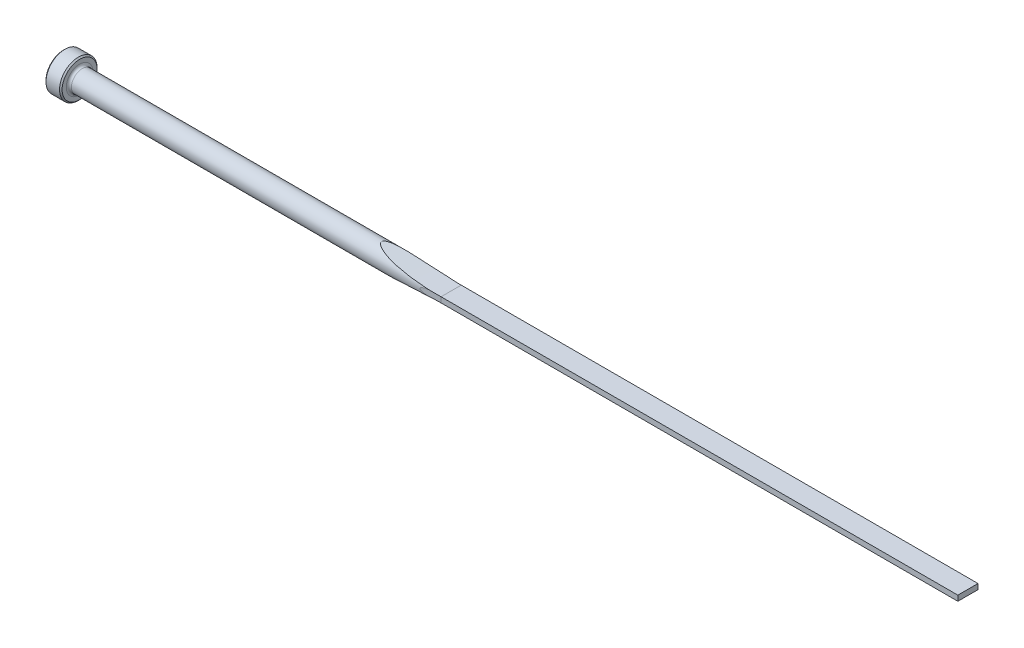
ISO-10303-21;
HEADER;
FILE_DESCRIPTION(('STEP AP214'),'2;1');
FILE_NAME('part.step','',(''),(''),'','','');
FILE_SCHEMA(('AUTOMOTIVE_DESIGN { 1 0 10303 214 1 1 1 1 }'));
ENDSEC;
DATA;
#1=APPLICATION_CONTEXT('core data for automotive mechanical design processes');
#2=APPLICATION_PROTOCOL_DEFINITION('international standard','automotive_design',2000,#1);
#3=PRODUCT_CONTEXT('',#1,'mechanical');
#4=PRODUCT('Part','Part','',(#3));
#5=PRODUCT_RELATED_PRODUCT_CATEGORY('part','',(#4));
#6=PRODUCT_DEFINITION_FORMATION('','',#4);
#7=PRODUCT_DEFINITION_CONTEXT('part definition',#1,'design');
#8=PRODUCT_DEFINITION('design','',#6,#7);
#9=PRODUCT_DEFINITION_SHAPE('','',#8);
#10=(LENGTH_UNIT() NAMED_UNIT(*) SI_UNIT(.MILLI.,.METRE.));
#11=(NAMED_UNIT(*) PLANE_ANGLE_UNIT() SI_UNIT($,.RADIAN.));
#12=(NAMED_UNIT(*) SI_UNIT($,.STERADIAN.) SOLID_ANGLE_UNIT());
#13=UNCERTAINTY_MEASURE_WITH_UNIT(LENGTH_MEASURE(1.E-05),#10,'distance_accuracy_value','');
#14=(GEOMETRIC_REPRESENTATION_CONTEXT(3) GLOBAL_UNCERTAINTY_ASSIGNED_CONTEXT((#13)) GLOBAL_UNIT_ASSIGNED_CONTEXT((#10,
#11,#12)) REPRESENTATION_CONTEXT('',''));
#15=CARTESIAN_POINT('',(0.,0.,0.));
#16=DIRECTION('',(0.,0.,1.));
#17=DIRECTION('',(1.,0.,0.));
#18=AXIS2_PLACEMENT_3D('',#15,#16,#17);
#19=CARTESIAN_POINT('',(0.,0.,0.));
#20=DIRECTION('',(-1.,0.,0.));
#21=DIRECTION('',(0.,0.,1.));
#22=AXIS2_PLACEMENT_3D('',#19,#20,#21);
#23=CYLINDRICAL_SURFACE('',#22,3.175);
#24=CARTESIAN_POINT('',(5.5118,0.,0.));
#25=DIRECTION('',(-1.,0.,0.));
#26=DIRECTION('',(0.,0.,1.));
#27=AXIS2_PLACEMENT_3D('',#24,#25,#26);
#28=CIRCLE('',#27,3.175);
#29=CARTESIAN_POINT('',(5.5118,0.,3.175));
#30=VERTEX_POINT('',#29);
#31=EDGE_CURVE('E153',#30,#30,#28,.F.);
#32=ORIENTED_EDGE('',*,*,#31,.T.);
#33=EDGE_LOOP('',(#32));
#34=FACE_BOUND('',#33,.T.);
#35=CARTESIAN_POINT('',(114.3,1.11760000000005,2.97179999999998));
#36=CARTESIAN_POINT('',(114.035795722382,1.11753103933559,2.97179889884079));
#37=CARTESIAN_POINT('',(113.771581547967,1.11446404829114,2.97297778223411));
#38=CARTESIAN_POINT('',(113.243191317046,1.10185346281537,2.97768913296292));
#39=CARTESIAN_POINT('',(112.979015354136,1.09230645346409,2.98122284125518));
#40=CARTESIAN_POINT('',(112.449383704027,1.06617269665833,2.99066695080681));
#41=CARTESIAN_POINT('',(112.183930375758,1.04954219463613,2.99659211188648));
#42=CARTESIAN_POINT('',(111.653787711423,1.00807205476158,3.01079697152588));
#43=CARTESIAN_POINT('',(111.389098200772,0.983234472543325,3.01907608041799));
#44=CARTESIAN_POINT('',(110.861578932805,0.92338352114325,3.03792875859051));
#45=CARTESIAN_POINT('',(110.598746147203,0.888396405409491,3.04849639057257));
#46=CARTESIAN_POINT('',(110.206465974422,0.825064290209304,3.06600005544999));
#47=CARTESIAN_POINT('',(110.076108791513,0.802161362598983,3.07210597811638));
#48=CARTESIAN_POINT('',(109.816355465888,0.751700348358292,3.08484243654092));
#49=CARTESIAN_POINT('',(109.686959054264,0.724143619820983,3.09147281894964));
#50=CARTESIAN_POINT('',(109.429407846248,0.662714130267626,3.10522998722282));
#51=CARTESIAN_POINT('',(109.301255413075,0.62883116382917,3.11235756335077));
#52=CARTESIAN_POINT('',(109.111128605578,0.570760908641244,3.12333709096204));
#53=CARTESIAN_POINT('',(109.048049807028,0.55017562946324,3.12704828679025));
#54=CARTESIAN_POINT('',(108.92304566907,0.505797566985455,3.13453462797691));
#55=CARTESIAN_POINT('',(108.861119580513,0.482006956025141,3.13830972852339));
#56=CARTESIAN_POINT('',(108.738826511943,0.429769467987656,3.14588980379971));
#57=CARTESIAN_POINT('',(108.678471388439,0.401294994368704,3.14969481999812));
#58=CARTESIAN_POINT('',(108.561395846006,0.337410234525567,3.1571914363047));
#59=CARTESIAN_POINT('',(108.504663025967,0.302025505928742,3.16088339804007));
#60=CARTESIAN_POINT('',(108.431845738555,0.243613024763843,3.16568281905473));
#61=CARTESIAN_POINT('',(108.411687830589,0.225790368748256,3.16701915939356));
#62=CARTESIAN_POINT('',(108.374124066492,0.187442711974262,3.16952077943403));
#63=CARTESIAN_POINT('',(108.356707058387,0.166929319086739,3.17068675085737));
#64=CARTESIAN_POINT('',(108.333583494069,0.132884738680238,3.17224001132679));
#65=CARTESIAN_POINT('',(108.326188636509,0.120518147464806,3.17273788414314));
#66=CARTESIAN_POINT('',(108.313260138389,0.0948283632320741,3.1736095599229));
#67=CARTESIAN_POINT('',(108.307725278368,0.081505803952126,3.17398344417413));
#68=CARTESIAN_POINT('',(108.299008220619,0.0538971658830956,3.1745727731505));
#69=CARTESIAN_POINT('',(108.295856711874,0.0396010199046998,3.17478615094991));
#70=CARTESIAN_POINT('',(108.2924789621,0.0106696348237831,3.17501485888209));
#71=CARTESIAN_POINT('',(108.292248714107,-0.00396511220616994,3.17503046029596));
#72=CARTESIAN_POINT('',(108.294559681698,-0.0309283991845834,3.17487397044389));
#73=CARTESIAN_POINT('',(108.29671675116,-0.0432925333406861,3.17472789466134));
#74=CARTESIAN_POINT('',(108.302965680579,-0.0675187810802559,3.17430516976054));
#75=CARTESIAN_POINT('',(108.307059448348,-0.0793803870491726,3.17402839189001));
#76=CARTESIAN_POINT('',(108.319137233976,-0.107852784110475,3.17321302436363));
#77=CARTESIAN_POINT('',(108.328045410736,-0.124065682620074,3.17261252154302));
#78=CARTESIAN_POINT('',(108.34823262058,-0.154926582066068,3.17125564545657));
#79=CARTESIAN_POINT('',(108.359518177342,-0.169570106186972,3.17049884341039));
#80=CARTESIAN_POINT('',(108.39443410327,-0.20990010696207,3.16816531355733));
#81=CARTESIAN_POINT('',(108.420099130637,-0.233790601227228,3.16645919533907));
#82=CARTESIAN_POINT('',(108.474292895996,-0.277993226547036,3.16288336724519));
#83=CARTESIAN_POINT('',(108.502830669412,-0.29829347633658,3.16101314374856));
#84=CARTESIAN_POINT('',(108.58234132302,-0.349789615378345,3.15584379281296));
#85=CARTESIAN_POINT('',(108.63488873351,-0.378519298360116,3.15247078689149));
#86=CARTESIAN_POINT('',(108.742307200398,-0.43132017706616,3.14567655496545));
#87=CARTESIAN_POINT('',(108.797183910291,-0.455379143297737,3.14225522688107));
#88=CARTESIAN_POINT('',(108.908570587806,-0.500302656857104,3.13541729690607));
#89=CARTESIAN_POINT('',(108.965087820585,-0.521149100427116,3.13200082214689));
#90=CARTESIAN_POINT('',(109.07889793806,-0.560302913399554,3.12523191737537));
#91=CARTESIAN_POINT('',(109.136189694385,-0.578613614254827,3.12187940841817));
#92=CARTESIAN_POINT('',(109.329729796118,-0.636913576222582,3.11074477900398));
#93=CARTESIAN_POINT('',(109.467313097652,-0.672489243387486,3.10314401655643));
#94=CARTESIAN_POINT('',(109.744130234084,-0.736755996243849,3.08850582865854));
#95=CARTESIAN_POINT('',(109.883365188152,-0.765442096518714,3.08146881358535));
#96=CARTESIAN_POINT('',(110.163129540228,-0.817784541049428,3.06799404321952));
#97=CARTESIAN_POINT('',(110.303661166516,-0.841429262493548,3.06155769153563));
#98=CARTESIAN_POINT('',(110.58537320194,-0.884713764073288,3.04932851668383));
#99=CARTESIAN_POINT('',(110.726553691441,-0.904353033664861,3.04353577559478));
#100=CARTESIAN_POINT('',(111.150689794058,-0.958348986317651,3.02714982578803));
#101=CARTESIAN_POINT('',(111.434309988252,-0.987796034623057,3.01754551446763));
#102=CARTESIAN_POINT('',(112.002086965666,-1.03680456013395,3.00105004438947));
#103=CARTESIAN_POINT('',(112.286242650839,-1.05637822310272,2.99415554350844));
#104=CARTESIAN_POINT('',(112.714916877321,-1.0796290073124,2.98581493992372));
#105=CARTESIAN_POINT('',(112.859256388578,-1.08638681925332,2.98335806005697));
#106=CARTESIAN_POINT('',(113.148064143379,-1.09788498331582,2.97914616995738));
#107=CARTESIAN_POINT('',(113.292532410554,-1.10262481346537,2.9773913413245));
#108=CARTESIAN_POINT('',(113.580840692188,-1.11015348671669,2.9745925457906));
#109=CARTESIAN_POINT('',(113.724680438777,-1.11295147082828,2.97354524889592));
#110=CARTESIAN_POINT('',(114.012346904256,-1.11667170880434,2.97214903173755));
#111=CARTESIAN_POINT('',(114.156173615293,-1.11759449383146,2.97179991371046));
#112=CARTESIAN_POINT('',(114.3,-1.11760000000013,2.97179999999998));
#113=B_SPLINE_CURVE_WITH_KNOTS('',3,(#35,#36,#37,#38,#39,#40,#41,#42,#43,#44,#45,#46,#47,#48,
#49,#50,#51,#52,#53,#54,#55,#56,#57,#58,#59,#60,#61,#62,#63,#64,#65,#66,#67,#68,#69,#70,#71,#72,
#73,#74,#75,#76,#77,#78,#79,#80,#81,#82,#83,#84,#85,#86,#87,#88,#89,#90,#91,#92,#93,#94,#95,#96,
#97,#98,#99,#100,#101,#102,#103,#104,#105,#106,#107,#108,#109,#110,#111,#112),.UNSPECIFIED.,.F.,
.F.,(4,2,2,2,2,2,2,2,2,2,2,2,2,2,2,2,2,2,2,2,2,2,2,2,2,2,2,2,2,2,2,2,2,2,2,2,2,2,4),(0.,
0.792608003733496,1.58563403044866,2.38363126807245,3.18142878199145,3.97718078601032,
4.37459807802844,4.77189959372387,5.16984765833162,5.36916585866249,5.5683496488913,
5.76875204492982,5.96842682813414,6.04909120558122,6.12941838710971,6.17255460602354,
6.21566248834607,6.2593164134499,6.30291045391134,6.34039079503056,6.37790813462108,
6.43311579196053,6.4884769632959,6.59320183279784,6.69826703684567,6.87774508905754,
7.05768691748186,7.23860836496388,7.41928981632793,7.84588397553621,8.27278590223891,
8.70066164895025,9.12859189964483,9.98423938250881,10.8388282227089,11.2723701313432,
11.7060241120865,12.137622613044,12.569098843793),.UNSPECIFIED.);
#114=CARTESIAN_POINT('',(110.485302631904,0.869282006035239,3.05368200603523));
#115=VERTEX_POINT('',#114);
#116=CARTESIAN_POINT('',(110.485302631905,-0.869282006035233,3.05368200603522));
#117=VERTEX_POINT('',#116);
#118=EDGE_CURVE('E156',#115,#117,#113,.T.);
#119=ORIENTED_EDGE('',*,*,#118,.F.);
#120=CARTESIAN_POINT('',(114.3,0.787399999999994,3.07581310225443));
#121=CARTESIAN_POINT('',(114.035543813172,0.787399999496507,3.07581083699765));
#122=CARTESIAN_POINT('',(113.771089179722,0.788580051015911,3.07551132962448));
#123=CARTESIAN_POINT('',(113.24220228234,0.793300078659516,3.07429803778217));
#124=CARTESIAN_POINT('',(112.977770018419,0.796840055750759,3.07338425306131));
#125=CARTESIAN_POINT('',(112.184418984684,0.81100169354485,3.0696912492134));
#126=CARTESIAN_POINT('',(111.655563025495,0.82516506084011,3.06596036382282));
#127=CARTESIAN_POINT('',(110.596850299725,0.862977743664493,3.05553241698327));
#128=CARTESIAN_POINT('',(110.066994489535,0.886651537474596,3.04882769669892));
#129=CARTESIAN_POINT('',(109.007960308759,0.943468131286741,3.03172836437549));
#130=CARTESIAN_POINT('',(108.478781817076,0.976608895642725,3.02133454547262));
#131=CARTESIAN_POINT('',(107.499749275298,1.04671882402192,2.99769210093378));
#132=CARTESIAN_POINT('',(107.04978615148,1.08238846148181,2.98509669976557));
#133=CARTESIAN_POINT('',(106.150579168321,1.16056445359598,2.9555818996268));
#134=CARTESIAN_POINT('',(105.701335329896,1.203071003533,2.93866237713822));
#135=CARTESIAN_POINT('',(104.803288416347,1.29494318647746,2.89935313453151));
#136=CARTESIAN_POINT('',(104.354486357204,1.34431625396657,2.87695746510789));
#137=CARTESIAN_POINT('',(103.458095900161,1.44984136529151,2.82525115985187));
#138=CARTESIAN_POINT('',(103.01050743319,1.50599301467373,2.79594092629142));
#139=CARTESIAN_POINT('',(102.11575117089,1.62515896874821,2.72840404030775));
#140=CARTESIAN_POINT('',(101.66858730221,1.6881902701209,2.69015502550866));
#141=CARTESIAN_POINT('',(100.776227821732,1.82090442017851,2.60217475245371));
#142=CARTESIAN_POINT('',(100.331032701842,1.89058884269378,2.5524407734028));
#143=CARTESIAN_POINT('',(99.6659910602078,1.99985162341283,2.46644191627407));
#144=CARTESIAN_POINT('',(99.4450024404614,2.03701989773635,2.43591445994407));
#145=CARTESIAN_POINT('',(99.0039601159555,2.11291046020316,2.37039160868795));
#146=CARTESIAN_POINT('',(98.7839063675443,2.15163267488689,2.33539642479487));
#147=CARTESIAN_POINT('',(98.3450648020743,2.23055506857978,2.2601373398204));
#148=CARTESIAN_POINT('',(98.1262764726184,2.27075459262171,2.21987575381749));
#149=CARTESIAN_POINT('',(97.6902406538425,2.35255542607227,2.13299737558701));
#150=CARTESIAN_POINT('',(97.4729929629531,2.39415654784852,2.08638143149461));
#151=CARTESIAN_POINT('',(97.1477545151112,2.45768704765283,2.01034767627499));
#152=CARTESIAN_POINT('',(97.0389864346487,2.47914563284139,1.98385903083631));
#153=CARTESIAN_POINT('',(96.822086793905,2.52235662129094,1.9286178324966));
#154=CARTESIAN_POINT('',(96.7139552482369,2.54410903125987,1.89986522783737));
#155=CARTESIAN_POINT('',(96.3903801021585,2.60982577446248,1.8097032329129));
#156=CARTESIAN_POINT('',(96.1760432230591,2.65419348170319,1.74445519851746));
#157=CARTESIAN_POINT('',(95.8591981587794,2.7209791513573,1.63665429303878));
#158=CARTESIAN_POINT('',(95.7548736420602,2.74316775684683,1.5992785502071));
#159=CARTESIAN_POINT('',(95.5477705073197,2.78760086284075,1.5205128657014));
#160=CARTESIAN_POINT('',(95.4449915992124,2.80984535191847,1.47912368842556));
#161=CARTESIAN_POINT('',(95.2417053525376,2.85421389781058,1.39157880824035));
#162=CARTESIAN_POINT('',(95.1411937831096,2.87633810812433,1.34543306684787));
#163=CARTESIAN_POINT('',(94.9430959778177,2.9202948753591,1.24716139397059));
#164=CARTESIAN_POINT('',(94.8455078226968,2.94212761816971,1.19503949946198));
#165=CARTESIAN_POINT('',(94.7117813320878,2.97227306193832,1.11659829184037));
#166=CARTESIAN_POINT('',(94.6738115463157,2.9808592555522,1.09349968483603));
#167=CARTESIAN_POINT('',(94.5987226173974,2.9978899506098,1.04590629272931));
#168=CARTESIAN_POINT('',(94.5616035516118,3.00633443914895,1.02141138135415));
#169=CARTESIAN_POINT('',(94.4515401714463,3.03144638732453,0.945421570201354));
#170=CARTESIAN_POINT('',(94.380121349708,3.04784006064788,0.891554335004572));
#171=CARTESIAN_POINT('',(94.2427883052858,3.07952922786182,0.775133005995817));
#172=CARTESIAN_POINT('',(94.1769534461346,3.09480855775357,0.712479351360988));
#173=CARTESIAN_POINT('',(94.0563432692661,3.12292613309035,0.576813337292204));
#174=CARTESIAN_POINT('',(94.0015101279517,3.13577711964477,0.503858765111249));
#175=CARTESIAN_POINT('',(93.9334503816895,3.15177595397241,0.385387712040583));
#176=CARTESIAN_POINT('',(93.9130844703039,3.15657317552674,0.34423696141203));
#177=CARTESIAN_POINT('',(93.878672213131,3.16468806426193,0.25921672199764));
#178=CARTESIAN_POINT('',(93.8646188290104,3.16800737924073,0.215350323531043));
#179=CARTESIAN_POINT('',(93.8441287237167,3.17284949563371,0.125287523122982));
#180=CARTESIAN_POINT('',(93.8377647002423,3.1743551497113,0.0790731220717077));
#181=CARTESIAN_POINT('',(93.833732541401,3.17530892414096,-0.0137573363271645));
#182=CARTESIAN_POINT('',(93.8360615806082,3.17475771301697,-0.060373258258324));
#183=CARTESIAN_POINT('',(93.8484201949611,3.17183542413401,-0.147654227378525));
#184=CARTESIAN_POINT('',(93.8576480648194,3.16965382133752,-0.188444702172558));
#185=CARTESIAN_POINT('',(93.8819667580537,3.16391143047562,-0.268119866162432));
#186=CARTESIAN_POINT('',(93.8970614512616,3.16034973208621,-0.307003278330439));
#187=CARTESIAN_POINT('',(93.9419420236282,3.149776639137,-0.403821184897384));
#188=CARTESIAN_POINT('',(93.9752036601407,3.14195464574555,-0.460042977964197));
#189=CARTESIAN_POINT('',(94.0496780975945,3.12449841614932,-0.566634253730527));
#190=CARTESIAN_POINT('',(94.0909151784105,3.11485864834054,-0.616985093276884));
#191=CARTESIAN_POINT('',(94.1763515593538,3.09496038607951,-0.709911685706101));
#192=CARTESIAN_POINT('',(94.2202749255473,3.08476245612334,-0.752759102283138));
#193=CARTESIAN_POINT('',(94.3115201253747,3.06365689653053,-0.834515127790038));
#194=CARTESIAN_POINT('',(94.3588452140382,3.05274858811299,-0.873419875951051));
#195=CARTESIAN_POINT('',(94.4560433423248,3.0304333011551,-0.947952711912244));
#196=CARTESIAN_POINT('',(94.50592175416,3.01902527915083,-0.983573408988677));
#197=CARTESIAN_POINT('',(94.6074943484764,2.9958898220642,-1.05193545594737));
#198=CARTESIAN_POINT('',(94.659187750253,2.98416252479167,-1.08467802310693));
#199=CARTESIAN_POINT('',(94.7974109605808,2.95293886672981,-1.16783092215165));
#200=CARTESIAN_POINT('',(94.88513100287,2.93325796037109,-1.2161903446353));
#201=CARTESIAN_POINT('',(95.0631864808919,2.89360215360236,-1.30773540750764));
#202=CARTESIAN_POINT('',(95.1535233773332,2.87362709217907,-1.35091808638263));
#203=CARTESIAN_POINT('',(95.336239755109,2.8335309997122,-1.43311613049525));
#204=CARTESIAN_POINT('',(95.4286227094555,2.81340976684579,-1.47212362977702));
#205=CARTESIAN_POINT('',(95.6148168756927,2.77317207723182,-1.54658525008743));
#206=CARTESIAN_POINT('',(95.708628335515,2.75305562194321,-1.5820387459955));
#207=CARTESIAN_POINT('',(95.9926824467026,2.69263186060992,-1.68424564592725));
#208=CARTESIAN_POINT('',(96.1846014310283,2.65245744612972,-1.74643627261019));
#209=CARTESIAN_POINT('',(96.4744533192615,2.59279838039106,-1.83281823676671));
#210=CARTESIAN_POINT('',(96.5713413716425,2.57302402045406,-1.86044719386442));
#211=CARTESIAN_POINT('',(96.7657197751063,2.53369185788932,-1.91366898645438));
#212=CARTESIAN_POINT('',(96.8632101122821,2.51413405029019,-1.93926186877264));
#213=CARTESIAN_POINT('',(97.1708756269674,2.45295213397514,-2.01698242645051));
#214=CARTESIAN_POINT('',(97.3819621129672,2.41176464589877,-2.06585236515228));
#215=CARTESIAN_POINT('',(97.8058251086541,2.33066711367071,-2.15692409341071));
#216=CARTESIAN_POINT('',(98.018601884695,2.29075727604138,-2.19912480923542));
#217=CARTESIAN_POINT('',(98.4455328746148,2.21230068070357,-2.27803601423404));
#218=CARTESIAN_POINT('',(98.6596877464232,2.17375464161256,-2.31474364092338));
#219=CARTESIAN_POINT('',(99.0890012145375,2.09811389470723,-2.38351552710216));
#220=CARTESIAN_POINT('',(99.3041598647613,2.0610192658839,-2.41557953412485));
#221=CARTESIAN_POINT('',(99.9518637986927,1.95181443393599,-2.50600220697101));
#222=CARTESIAN_POINT('',(100.385625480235,1.88196933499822,-2.55841192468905));
#223=CARTESIAN_POINT('',(101.255208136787,1.74857514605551,-2.65135263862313));
#224=CARTESIAN_POINT('',(101.691028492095,1.68502427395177,-2.69188700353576));
#225=CARTESIAN_POINT('',(102.564605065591,1.56427552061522,-2.76380276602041));
#226=CARTESIAN_POINT('',(103.002362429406,1.50708213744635,-2.79517770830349));
#227=CARTESIAN_POINT('',(103.879151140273,1.3991729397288,-2.85072181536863));
#228=CARTESIAN_POINT('',(104.318182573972,1.34845757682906,-2.8748904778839));
#229=CARTESIAN_POINT('',(105.196664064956,1.25361567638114,-2.91749372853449));
#230=CARTESIAN_POINT('',(105.636112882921,1.20948085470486,-2.93593555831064));
#231=CARTESIAN_POINT('',(106.515786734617,1.12775252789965,-2.96828666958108));
#232=CARTESIAN_POINT('',(106.956011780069,1.09015912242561,-2.98219588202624));
#233=CARTESIAN_POINT('',(107.9721267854,1.01101466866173,-3.01010743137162));
#234=CARTESIAN_POINT('',(108.548233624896,0.971783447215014,-3.0228311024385));
#235=CARTESIAN_POINT('',(109.701337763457,0.904541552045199,-3.04362622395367));
#236=CARTESIAN_POINT('',(110.278335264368,0.876533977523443,-3.05169638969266));
#237=CARTESIAN_POINT('',(111.429420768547,0.831901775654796,-3.06416391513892));
#238=CARTESIAN_POINT('',(112.003505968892,0.815211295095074,-3.06858255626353));
#239=CARTESIAN_POINT('',(112.864711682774,0.798523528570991,-3.07294853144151));
#240=CARTESIAN_POINT('',(113.151751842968,0.794352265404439,-3.07402686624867));
#241=CARTESIAN_POINT('',(113.725860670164,0.788790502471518,-3.07545758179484));
#242=CARTESIAN_POINT('',(114.012929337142,0.787400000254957,-3.07580996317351));
#243=CARTESIAN_POINT('',(114.3,0.7874,-3.07581310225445));
#244=B_SPLINE_CURVE_WITH_KNOTS('',3,(#120,#121,#122,#123,#124,#125,#126,#127,#128,#129,#130,
#131,#132,#133,#134,#135,#136,#137,#138,#139,#140,#141,#142,#143,#144,#145,#146,#147,#148,#149,
#150,#151,#152,#153,#154,#155,#156,#157,#158,#159,#160,#161,#162,#163,#164,#165,#166,#167,#168,
#169,#170,#171,#172,#173,#174,#175,#176,#177,#178,#179,#180,#181,#182,#183,#184,#185,#186,#187,
#188,#189,#190,#191,#192,#193,#194,#195,#196,#197,#198,#199,#200,#201,#202,#203,#204,#205,#206,
#207,#208,#209,#210,#211,#212,#213,#214,#215,#216,#217,#218,#219,#220,#221,#222,#223,#224,#225,
#226,#227,#228,#229,#230,#231,#232,#233,#234,#235,#236,#237,#238,#239,#240,#241,#242,#243),
.UNSPECIFIED.,.F.,.F.,(4,2,2,2,2,2,2,2,2,2,2,2,2,2,2,2,2,2,2,2,2,2,2,2,2,2,2,2,2,2,2,2,2,2,2,2,
2,2,2,2,2,2,2,2,2,2,2,2,2,2,2,2,2,2,2,2,2,2,2,2,2,4),(0.,0.793362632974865,1.58672559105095,
3.17380261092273,4.76499095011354,6.35583739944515,7.71042211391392,9.06504552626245,
10.4211471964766,11.7771699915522,13.1366222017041,14.4963967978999,15.1748434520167,
15.8532580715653,16.5313754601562,17.2094024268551,17.5513342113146,17.8932738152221,
18.5780521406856,18.917044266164,19.2559719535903,19.5942037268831,19.9322083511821,
20.0679784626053,20.203760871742,20.4761399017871,20.7519011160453,21.0261726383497,
21.1642406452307,21.302154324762,21.4413619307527,21.5805242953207,21.705627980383,
21.8308143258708,22.0270516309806,22.2238960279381,22.4102246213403,22.5967339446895,
22.783653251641,22.9704931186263,23.2765002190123,23.5826815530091,23.889429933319,
24.1962321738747,24.8129775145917,25.12098443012,25.4289842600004,26.0904791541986,
26.7520804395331,27.4140252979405,28.0760061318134,29.4030977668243,30.7298125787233,
32.0574601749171,33.3852002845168,34.7112545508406,36.037329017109,37.7699311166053,
39.5030113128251,41.2259182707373,42.087123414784,42.948327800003),.UNSPECIFIED.);
#245=CARTESIAN_POINT('',(110.485302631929,0.869282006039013,-3.05368200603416));
#246=VERTEX_POINT('',#245);
#247=EDGE_CURVE('E106',#115,#246,#244,.T.);
#248=ORIENTED_EDGE('',*,*,#247,.T.);
#249=CARTESIAN_POINT('',(114.3,1.11760000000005,-2.97179999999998));
#250=CARTESIAN_POINT('',(114.035795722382,1.11753103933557,-2.9717988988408));
#251=CARTESIAN_POINT('',(113.771581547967,1.11446404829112,-2.97297778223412));
#252=CARTESIAN_POINT('',(113.243191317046,1.10185346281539,-2.97768913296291));
#253=CARTESIAN_POINT('',(112.979015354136,1.09230645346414,-2.98122284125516));
#254=CARTESIAN_POINT('',(112.449383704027,1.06617269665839,-2.99066695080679));
#255=CARTESIAN_POINT('',(112.183930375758,1.04954219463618,-2.99659211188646));
#256=CARTESIAN_POINT('',(111.653787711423,1.00807205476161,-3.01079697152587));
#257=CARTESIAN_POINT('',(111.389098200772,0.983234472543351,-3.01907608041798));
#258=CARTESIAN_POINT('',(110.861578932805,0.923383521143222,-3.03792875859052));
#259=CARTESIAN_POINT('',(110.598746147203,0.888396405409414,-3.04849639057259));
#260=CARTESIAN_POINT('',(110.206465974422,0.825064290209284,-3.06600005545));
#261=CARTESIAN_POINT('',(110.076108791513,0.802161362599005,-3.07210597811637));
#262=CARTESIAN_POINT('',(109.816355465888,0.751700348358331,-3.08484243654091));
#263=CARTESIAN_POINT('',(109.686959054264,0.724143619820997,-3.09147281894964));
#264=CARTESIAN_POINT('',(109.429407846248,0.662714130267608,-3.10522998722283));
#265=CARTESIAN_POINT('',(109.301255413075,0.628831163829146,-3.11235756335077));
#266=CARTESIAN_POINT('',(109.111128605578,0.570760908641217,-3.12333709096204));
#267=CARTESIAN_POINT('',(109.048049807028,0.55017562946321,-3.12704828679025));
#268=CARTESIAN_POINT('',(108.92304566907,0.505797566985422,-3.13453462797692));
#269=CARTESIAN_POINT('',(108.861119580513,0.482006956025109,-3.13830972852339));
#270=CARTESIAN_POINT('',(108.738826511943,0.42976946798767,-3.1458898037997));
#271=CARTESIAN_POINT('',(108.678471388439,0.401294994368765,-3.14969481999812));
#272=CARTESIAN_POINT('',(108.561395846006,0.337410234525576,-3.15719143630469));
#273=CARTESIAN_POINT('',(108.504663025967,0.302025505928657,-3.16088339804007));
#274=CARTESIAN_POINT('',(108.431845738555,0.243613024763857,-3.16568281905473));
#275=CARTESIAN_POINT('',(108.411687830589,0.225790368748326,-3.16701915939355));
#276=CARTESIAN_POINT('',(108.374124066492,0.187442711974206,-3.16952077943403));
#277=CARTESIAN_POINT('',(108.356707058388,0.166929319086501,-3.17068675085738));
#278=CARTESIAN_POINT('',(108.333583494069,0.132884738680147,-3.1722400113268));
#279=CARTESIAN_POINT('',(108.326188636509,0.120518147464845,-3.17273788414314));
#280=CARTESIAN_POINT('',(108.313260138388,0.0948283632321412,-3.1736095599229));
#281=CARTESIAN_POINT('',(108.307725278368,0.0815058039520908,-3.17398344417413));
#282=CARTESIAN_POINT('',(108.299008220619,0.0538971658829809,-3.1745727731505));
#283=CARTESIAN_POINT('',(108.295856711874,0.0396010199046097,-3.17478615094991));
#284=CARTESIAN_POINT('',(108.2924789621,0.0106696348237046,-3.17501485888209));
#285=CARTESIAN_POINT('',(108.292248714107,-0.00396511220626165,-3.17503046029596));
#286=CARTESIAN_POINT('',(108.294559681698,-0.0309283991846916,-3.17487397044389));
#287=CARTESIAN_POINT('',(108.29671675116,-0.0432925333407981,-3.17472789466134));
#288=CARTESIAN_POINT('',(108.302965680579,-0.0675187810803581,-3.17430516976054));
#289=CARTESIAN_POINT('',(108.307059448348,-0.0793803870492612,-3.17402839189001));
#290=CARTESIAN_POINT('',(108.319137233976,-0.107852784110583,-3.17321302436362));
#291=CARTESIAN_POINT('',(108.328045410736,-0.124065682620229,-3.17261252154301));
#292=CARTESIAN_POINT('',(108.34823262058,-0.154926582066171,-3.17125564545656));
#293=CARTESIAN_POINT('',(108.359518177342,-0.169570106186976,-3.17049884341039));
#294=CARTESIAN_POINT('',(108.39443410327,-0.209900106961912,-3.16816531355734));
#295=CARTESIAN_POINT('',(108.420099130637,-0.233790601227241,-3.16645919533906));
#296=CARTESIAN_POINT('',(108.474292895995,-0.27799322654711,-3.16288336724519));
#297=CARTESIAN_POINT('',(108.502830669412,-0.298293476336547,-3.16101314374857));
#298=CARTESIAN_POINT('',(108.58234132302,-0.349789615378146,-3.15584379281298));
#299=CARTESIAN_POINT('',(108.63488873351,-0.378519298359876,-3.15247078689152));
#300=CARTESIAN_POINT('',(108.742307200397,-0.431320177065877,-3.14567655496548));
#301=CARTESIAN_POINT('',(108.79718391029,-0.455379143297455,-3.14225522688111));
#302=CARTESIAN_POINT('',(108.908570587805,-0.500302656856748,-3.13541729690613));
#303=CARTESIAN_POINT('',(108.965087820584,-0.521149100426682,-3.13200082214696));
#304=CARTESIAN_POINT('',(109.078897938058,-0.56030291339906,-3.12523191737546));
#305=CARTESIAN_POINT('',(109.136189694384,-0.578613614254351,-3.12187940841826));
#306=CARTESIAN_POINT('',(109.329729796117,-0.636913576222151,-3.11074477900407));
#307=CARTESIAN_POINT('',(109.46731309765,-0.672489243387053,-3.10314401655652));
#308=CARTESIAN_POINT('',(109.744130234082,-0.736755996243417,-3.08850582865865));
#309=CARTESIAN_POINT('',(109.88336518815,-0.765442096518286,-3.08146881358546));
#310=CARTESIAN_POINT('',(110.163129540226,-0.81778454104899,-3.06799404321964));
#311=CARTESIAN_POINT('',(110.303661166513,-0.841429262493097,-3.06155769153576));
#312=CARTESIAN_POINT('',(110.585373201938,-0.884713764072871,-3.04932851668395));
#313=CARTESIAN_POINT('',(110.726553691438,-0.904353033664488,-3.04353577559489));
#314=CARTESIAN_POINT('',(111.150689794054,-0.958348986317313,-3.02714982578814));
#315=CARTESIAN_POINT('',(111.434309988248,-0.987796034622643,-3.01754551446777));
#316=CARTESIAN_POINT('',(112.002086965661,-1.03680456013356,-3.0010500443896));
#317=CARTESIAN_POINT('',(112.286242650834,-1.05637822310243,-2.99415554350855));
#318=CARTESIAN_POINT('',(112.714916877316,-1.07962900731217,-2.98581493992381));
#319=CARTESIAN_POINT('',(112.859256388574,-1.0863868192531,-2.98335806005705));
#320=CARTESIAN_POINT('',(113.148064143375,-1.09788498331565,-2.97914616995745));
#321=CARTESIAN_POINT('',(113.292532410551,-1.10262481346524,-2.97739134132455));
#322=CARTESIAN_POINT('',(113.580840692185,-1.11015348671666,-2.97459254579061));
#323=CARTESIAN_POINT('',(113.724680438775,-1.11295147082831,-2.97354524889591));
#324=CARTESIAN_POINT('',(114.012346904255,-1.11667170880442,-2.97214903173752));
#325=CARTESIAN_POINT('',(114.156173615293,-1.11759449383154,-2.97179991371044));
#326=CARTESIAN_POINT('',(114.3,-1.11760000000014,-2.97179999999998));
#327=B_SPLINE_CURVE_WITH_KNOTS('',3,(#249,#250,#251,#252,#253,#254,#255,#256,#257,#258,#259,
#260,#261,#262,#263,#264,#265,#266,#267,#268,#269,#270,#271,#272,#273,#274,#275,#276,#277,#278,
#279,#280,#281,#282,#283,#284,#285,#286,#287,#288,#289,#290,#291,#292,#293,#294,#295,#296,#297,
#298,#299,#300,#301,#302,#303,#304,#305,#306,#307,#308,#309,#310,#311,#312,#313,#314,#315,#316,
#317,#318,#319,#320,#321,#322,#323,#324,#325,#326),.UNSPECIFIED.,.F.,.F.,(4,2,2,2,2,2,2,2,2,2,2,
2,2,2,2,2,2,2,2,2,2,2,2,2,2,2,2,2,2,2,2,2,2,2,2,2,2,2,4),(0.,0.792608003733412,1.58563403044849,
2.38363126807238,3.18142878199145,3.97718078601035,4.37459807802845,4.77189959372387,
5.16984765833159,5.36916585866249,5.5683496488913,5.76875204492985,5.96842682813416,
6.04909120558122,6.12941838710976,6.1725546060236,6.21566248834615,6.25931641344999,
6.30291045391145,6.34039079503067,6.37790813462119,6.43311579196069,6.48847696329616,
6.59320183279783,6.69826703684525,6.87774508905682,7.05768691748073,7.23860836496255,
7.41928981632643,7.84588397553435,8.27278590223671,8.70066164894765,9.12859189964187,
9.98423938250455,10.8388282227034,11.272370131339,11.7060241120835,12.1376226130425,
12.569098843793),.UNSPECIFIED.);
#328=CARTESIAN_POINT('',(110.485302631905,-0.869282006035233,-3.05368200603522));
#329=VERTEX_POINT('',#328);
#330=EDGE_CURVE('E175',#246,#329,#327,.T.);
#331=ORIENTED_EDGE('',*,*,#330,.T.);
#332=CARTESIAN_POINT('',(114.3,-0.787399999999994,3.07581310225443));
#333=CARTESIAN_POINT('',(114.035543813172,-0.787399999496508,3.07581083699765));
#334=CARTESIAN_POINT('',(113.771089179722,-0.788580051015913,3.07551132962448));
#335=CARTESIAN_POINT('',(113.24220228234,-0.793300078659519,3.07429803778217));
#336=CARTESIAN_POINT('',(112.977770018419,-0.796840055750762,3.07338425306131));
#337=CARTESIAN_POINT('',(112.184418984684,-0.811001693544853,3.0696912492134));
#338=CARTESIAN_POINT('',(111.655563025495,-0.825165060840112,3.06596036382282));
#339=CARTESIAN_POINT('',(110.596850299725,-0.862977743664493,3.05553241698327));
#340=CARTESIAN_POINT('',(110.066994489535,-0.886651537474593,3.04882769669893));
#341=CARTESIAN_POINT('',(109.007960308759,-0.943468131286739,3.03172836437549));
#342=CARTESIAN_POINT('',(108.478781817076,-0.976608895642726,3.02133454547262));
#343=CARTESIAN_POINT('',(107.499749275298,-1.04671882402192,2.99769210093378));
#344=CARTESIAN_POINT('',(107.04978615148,-1.0823884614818,2.98509669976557));
#345=CARTESIAN_POINT('',(106.150579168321,-1.16056445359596,2.95558189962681));
#346=CARTESIAN_POINT('',(105.701335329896,-1.20307100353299,2.93866237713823));
#347=CARTESIAN_POINT('',(104.803288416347,-1.29494318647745,2.89935313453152));
#348=CARTESIAN_POINT('',(104.354486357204,-1.34431625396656,2.8769574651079));
#349=CARTESIAN_POINT('',(103.458095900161,-1.44984136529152,2.82525115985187));
#350=CARTESIAN_POINT('',(103.01050743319,-1.50599301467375,2.79594092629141));
#351=CARTESIAN_POINT('',(102.11575117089,-1.62515896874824,2.72840404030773));
#352=CARTESIAN_POINT('',(101.66858730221,-1.68819027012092,2.69015502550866));
#353=CARTESIAN_POINT('',(100.776227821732,-1.82090442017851,2.6021747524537));
#354=CARTESIAN_POINT('',(100.331032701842,-1.89058884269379,2.55244077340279));
#355=CARTESIAN_POINT('',(99.6659910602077,-1.99985162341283,2.46644191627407));
#356=CARTESIAN_POINT('',(99.4450024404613,-2.03701989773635,2.43591445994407));
#357=CARTESIAN_POINT('',(99.0039601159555,-2.11291046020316,2.37039160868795));
#358=CARTESIAN_POINT('',(98.7839063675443,-2.1516326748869,2.33539642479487));
#359=CARTESIAN_POINT('',(98.3450648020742,-2.23055506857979,2.26013733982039));
#360=CARTESIAN_POINT('',(98.1262764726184,-2.27075459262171,2.21987575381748));
#361=CARTESIAN_POINT('',(97.6902406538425,-2.35255542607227,2.13299737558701));
#362=CARTESIAN_POINT('',(97.4729929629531,-2.39415654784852,2.08638143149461));
#363=CARTESIAN_POINT('',(97.1477545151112,-2.45768704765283,2.01034767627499));
#364=CARTESIAN_POINT('',(97.0389864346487,-2.47914563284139,1.98385903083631));
#365=CARTESIAN_POINT('',(96.822086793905,-2.52235662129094,1.92861783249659));
#366=CARTESIAN_POINT('',(96.7139552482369,-2.54410903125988,1.89986522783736));
#367=CARTESIAN_POINT('',(96.3903801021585,-2.60982577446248,1.80970323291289));
#368=CARTESIAN_POINT('',(96.1760432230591,-2.65419348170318,1.74445519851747));
#369=CARTESIAN_POINT('',(95.8591981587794,-2.72097915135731,1.63665429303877));
#370=CARTESIAN_POINT('',(95.7548736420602,-2.74316775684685,1.59927855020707));
#371=CARTESIAN_POINT('',(95.5477705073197,-2.78760086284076,1.52051286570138));
#372=CARTESIAN_POINT('',(95.4449915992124,-2.80984535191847,1.47912368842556));
#373=CARTESIAN_POINT('',(95.2417053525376,-2.85421389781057,1.39157880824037));
#374=CARTESIAN_POINT('',(95.1411937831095,-2.87633810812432,1.34543306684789));
#375=CARTESIAN_POINT('',(94.9430959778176,-2.9202948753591,1.2471613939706));
#376=CARTESIAN_POINT('',(94.8455078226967,-2.9421276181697,1.19503949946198));
#377=CARTESIAN_POINT('',(94.7117813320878,-2.97227306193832,1.11659829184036));
#378=CARTESIAN_POINT('',(94.6738115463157,-2.98085925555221,1.09349968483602));
#379=CARTESIAN_POINT('',(94.5987226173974,-2.99788995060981,1.0459062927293));
#380=CARTESIAN_POINT('',(94.5616035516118,-3.00633443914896,1.02141138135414));
#381=CARTESIAN_POINT('',(94.4515401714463,-3.03144638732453,0.945421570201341));
#382=CARTESIAN_POINT('',(94.380121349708,-3.04784006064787,0.89155433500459));
#383=CARTESIAN_POINT('',(94.2427883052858,-3.07952922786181,0.775133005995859));
#384=CARTESIAN_POINT('',(94.1769534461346,-3.09480855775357,0.712479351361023));
#385=CARTESIAN_POINT('',(94.0563432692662,-3.12292613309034,0.57681333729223));
#386=CARTESIAN_POINT('',(94.0015101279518,-3.13577711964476,0.503858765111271));
#387=CARTESIAN_POINT('',(93.9334503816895,-3.1517759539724,0.385387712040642));
#388=CARTESIAN_POINT('',(93.9130844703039,-3.15657317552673,0.344236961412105));
#389=CARTESIAN_POINT('',(93.878672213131,-3.16468806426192,0.259216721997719));
#390=CARTESIAN_POINT('',(93.8646188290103,-3.16800737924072,0.215350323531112));
#391=CARTESIAN_POINT('',(93.8441287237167,-3.17284949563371,0.125287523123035));
#392=CARTESIAN_POINT('',(93.8377647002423,-3.1743551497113,0.0790731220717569));
#393=CARTESIAN_POINT('',(93.833732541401,-3.17530892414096,-0.0137573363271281));
#394=CARTESIAN_POINT('',(93.8360615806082,-3.17475771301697,-0.060373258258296));
#395=CARTESIAN_POINT('',(93.8484201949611,-3.17183542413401,-0.147654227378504));
#396=CARTESIAN_POINT('',(93.8576480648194,-3.16965382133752,-0.188444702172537));
#397=CARTESIAN_POINT('',(93.8819667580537,-3.16391143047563,-0.268119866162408));
#398=CARTESIAN_POINT('',(93.8970614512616,-3.16034973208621,-0.307003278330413));
#399=CARTESIAN_POINT('',(93.9419420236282,-3.14977663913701,-0.403821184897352));
#400=CARTESIAN_POINT('',(93.9752036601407,-3.14195464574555,-0.460042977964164));
#401=CARTESIAN_POINT('',(94.0496780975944,-3.12449841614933,-0.566634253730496));
#402=CARTESIAN_POINT('',(94.0909151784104,-3.11485864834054,-0.616985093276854));
#403=CARTESIAN_POINT('',(94.1763515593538,-3.09496038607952,-0.709911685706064));
#404=CARTESIAN_POINT('',(94.2202749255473,-3.08476245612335,-0.752759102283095));
#405=CARTESIAN_POINT('',(94.3115201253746,-3.06365689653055,-0.834515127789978));
#406=CARTESIAN_POINT('',(94.3588452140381,-3.05274858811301,-0.873419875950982));
#407=CARTESIAN_POINT('',(94.4560433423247,-3.03043330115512,-0.947952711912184));
#408=CARTESIAN_POINT('',(94.5059217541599,-3.01902527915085,-0.983573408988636));
#409=CARTESIAN_POINT('',(94.6074943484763,-2.99588982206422,-1.05193545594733));
#410=CARTESIAN_POINT('',(94.659187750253,-2.98416252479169,-1.08467802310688));
#411=CARTESIAN_POINT('',(94.7974109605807,-2.95293886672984,-1.16783092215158));
#412=CARTESIAN_POINT('',(94.8851310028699,-2.93325796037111,-1.21619034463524));
#413=CARTESIAN_POINT('',(95.0631864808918,-2.89360215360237,-1.3077354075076));
#414=CARTESIAN_POINT('',(95.1535233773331,-2.87362709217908,-1.3509180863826));
#415=CARTESIAN_POINT('',(95.3362397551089,-2.83353099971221,-1.43311613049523));
#416=CARTESIAN_POINT('',(95.4286227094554,-2.8134097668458,-1.47212362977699));
#417=CARTESIAN_POINT('',(95.6148168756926,-2.77317207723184,-1.54658525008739));
#418=CARTESIAN_POINT('',(95.708628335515,-2.75305562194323,-1.58203874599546));
#419=CARTESIAN_POINT('',(95.9926824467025,-2.69263186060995,-1.68424564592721));
#420=CARTESIAN_POINT('',(96.1846014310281,-2.65245744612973,-1.74643627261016));
#421=CARTESIAN_POINT('',(96.4744533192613,-2.5927983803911,-1.83281823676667));
#422=CARTESIAN_POINT('',(96.5713413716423,-2.5730240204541,-1.86044719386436));
#423=CARTESIAN_POINT('',(96.7657197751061,-2.53369185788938,-1.9136689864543));
#424=CARTESIAN_POINT('',(96.8632101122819,-2.51413405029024,-1.93926186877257));
#425=CARTESIAN_POINT('',(97.1708756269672,-2.4529521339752,-2.01698242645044));
#426=CARTESIAN_POINT('',(97.3819621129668,-2.41176464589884,-2.0658523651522));
#427=CARTESIAN_POINT('',(97.8058251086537,-2.33066711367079,-2.15692409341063));
#428=CARTESIAN_POINT('',(98.0186018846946,-2.29075727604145,-2.19912480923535));
#429=CARTESIAN_POINT('',(98.4455328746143,-2.21230068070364,-2.27803601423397));
#430=CARTESIAN_POINT('',(98.6596877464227,-2.17375464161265,-2.3147436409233));
#431=CARTESIAN_POINT('',(99.089001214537,-2.09811389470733,-2.38351552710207));
#432=CARTESIAN_POINT('',(99.3041598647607,-2.061019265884,-2.41557953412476));
#433=CARTESIAN_POINT('',(99.951863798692,-1.9518144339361,-2.50600220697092));
#434=CARTESIAN_POINT('',(100.385625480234,-1.88196933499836,-2.55841192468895));
#435=CARTESIAN_POINT('',(101.255208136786,-1.74857514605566,-2.65135263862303));
#436=CARTESIAN_POINT('',(101.691028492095,-1.6850242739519,-2.69188700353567));
#437=CARTESIAN_POINT('',(102.56460506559,-1.56427552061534,-2.76380276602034));
#438=CARTESIAN_POINT('',(103.002362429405,-1.50708213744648,-2.79517770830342));
#439=CARTESIAN_POINT('',(103.879151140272,-1.39917293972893,-2.85072181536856));
#440=CARTESIAN_POINT('',(104.318182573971,-1.34845757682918,-2.87489047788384));
#441=CARTESIAN_POINT('',(105.196664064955,-1.25361567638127,-2.91749372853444));
#442=CARTESIAN_POINT('',(105.63611288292,-1.209480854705,-2.93593555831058));
#443=CARTESIAN_POINT('',(106.515786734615,-1.12775252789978,-2.96828666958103));
#444=CARTESIAN_POINT('',(106.956011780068,-1.09015912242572,-2.9821958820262));
#445=CARTESIAN_POINT('',(107.972126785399,-1.01101466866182,-3.01010743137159));
#446=CARTESIAN_POINT('',(108.548233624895,-0.971783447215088,-3.02283110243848));
#447=CARTESIAN_POINT('',(109.701337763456,-0.904541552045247,-3.04362622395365));
#448=CARTESIAN_POINT('',(110.278335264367,-0.876533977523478,-3.05169638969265));
#449=CARTESIAN_POINT('',(111.429420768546,-0.831901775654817,-3.06416391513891));
#450=CARTESIAN_POINT('',(112.003505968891,-0.815211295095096,-3.06858255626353));
#451=CARTESIAN_POINT('',(112.864711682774,-0.798523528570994,-3.07294853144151));
#452=CARTESIAN_POINT('',(113.151751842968,-0.794352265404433,-3.07402686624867));
#453=CARTESIAN_POINT('',(113.725860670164,-0.788790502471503,-3.07545758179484));
#454=CARTESIAN_POINT('',(114.012929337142,-0.787400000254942,-3.07580996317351));
#455=CARTESIAN_POINT('',(114.3,-0.787399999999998,-3.07581310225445));
#456=B_SPLINE_CURVE_WITH_KNOTS('',3,(#332,#333,#334,#335,#336,#337,#338,#339,#340,#341,#342,
#343,#344,#345,#346,#347,#348,#349,#350,#351,#352,#353,#354,#355,#356,#357,#358,#359,#360,#361,
#362,#363,#364,#365,#366,#367,#368,#369,#370,#371,#372,#373,#374,#375,#376,#377,#378,#379,#380,
#381,#382,#383,#384,#385,#386,#387,#388,#389,#390,#391,#392,#393,#394,#395,#396,#397,#398,#399,
#400,#401,#402,#403,#404,#405,#406,#407,#408,#409,#410,#411,#412,#413,#414,#415,#416,#417,#418,
#419,#420,#421,#422,#423,#424,#425,#426,#427,#428,#429,#430,#431,#432,#433,#434,#435,#436,#437,
#438,#439,#440,#441,#442,#443,#444,#445,#446,#447,#448,#449,#450,#451,#452,#453,#454,#455),
.UNSPECIFIED.,.F.,.F.,(4,2,2,2,2,2,2,2,2,2,2,2,2,2,2,2,2,2,2,2,2,2,2,2,2,2,2,2,2,2,2,2,2,2,2,2,
2,2,2,2,2,2,2,2,2,2,2,2,2,2,2,2,2,2,2,2,2,2,2,2,2,4),(0.,0.793362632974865,1.58672559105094,
3.17380261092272,4.76499095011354,6.35583739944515,7.71042211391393,9.06504552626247,
10.4211471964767,11.7771699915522,13.1366222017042,14.4963967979,15.1748434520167,
15.8532580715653,16.5313754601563,17.2094024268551,17.5513342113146,17.8932738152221,
18.5780521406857,18.917044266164,19.2559719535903,19.5942037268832,19.9322083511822,
20.0679784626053,20.2037608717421,20.4761399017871,20.7519011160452,21.0261726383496,
21.1642406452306,21.302154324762,21.4413619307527,21.5805242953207,21.705627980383,
21.8308143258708,22.0270516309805,22.223896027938,22.4102246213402,22.5967339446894,
22.7836532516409,22.9704931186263,23.2765002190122,23.582681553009,23.8894299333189,
24.1962321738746,24.8129775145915,25.1209844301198,25.4289842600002,26.0904791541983,
26.7520804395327,27.41402529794,28.0760061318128,29.4030977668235,30.7298125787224,
32.057460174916,33.3852002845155,34.7112545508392,36.0373290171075,37.7699311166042,
39.5030113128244,41.225918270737,42.0871234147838,42.948327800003),.UNSPECIFIED.);
#457=EDGE_CURVE('E105',#117,#329,#456,.T.);
#458=ORIENTED_EDGE('',*,*,#457,.F.);
#459=EDGE_LOOP('',(#119,#248,#331,#458));
#460=FACE_BOUND('',#459,.T.);
#461=ADVANCED_FACE('F33',(#34,#460),#23,.T.);
#462=CARTESIAN_POINT('',(266.7,3.175,0.));
#463=DIRECTION('',(-1.,0.,0.));
#464=DIRECTION('',(0.,0.,1.));
#465=AXIS2_PLACEMENT_3D('',#462,#463,#464);
#466=PLANE('',#465);
#467=DIRECTION('',(0.,1.,0.));
#468=VECTOR('',#467,1.);
#469=CARTESIAN_POINT('',(266.7,-5.5499,2.97180000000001));
#470=LINE('',#469,#468);
#471=CARTESIAN_POINT('',(266.7,-0.787400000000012,2.97180000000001));
#472=VERTEX_POINT('',#471);
#473=CARTESIAN_POINT('',(266.7,0.787400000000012,2.97180000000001));
#474=VERTEX_POINT('',#473);
#475=EDGE_CURVE('E87',#472,#474,#470,.T.);
#476=ORIENTED_EDGE('',*,*,#475,.F.);
#477=DIRECTION('',(0.,0.,1.));
#478=VECTOR('',#477,1.);
#479=CARTESIAN_POINT('',(266.7,-0.787400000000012,0.));
#480=LINE('',#479,#478);
#481=CARTESIAN_POINT('',(266.7,-0.787400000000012,-2.9718));
#482=VERTEX_POINT('',#481);
#483=EDGE_CURVE('E100',#482,#472,#480,.T.);
#484=ORIENTED_EDGE('',*,*,#483,.F.);
#485=DIRECTION('',(0.,1.,0.));
#486=VECTOR('',#485,1.);
#487=CARTESIAN_POINT('',(266.7,-5.5499,-2.97180000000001));
#488=LINE('',#487,#486);
#489=CARTESIAN_POINT('',(266.7,0.787400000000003,-2.97180000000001));
#490=VERTEX_POINT('',#489);
#491=EDGE_CURVE('E56',#482,#490,#488,.T.);
#492=ORIENTED_EDGE('',*,*,#491,.T.);
#493=DIRECTION('',(0.,0.,1.));
#494=VECTOR('',#493,1.);
#495=CARTESIAN_POINT('',(266.7,0.787400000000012,0.));
#496=LINE('',#495,#494);
#497=EDGE_CURVE('E102',#490,#474,#496,.T.);
#498=ORIENTED_EDGE('',*,*,#497,.T.);
#499=EDGE_LOOP('',(#476,#484,#492,#498));
#500=FACE_BOUND('',#499,.T.);
#501=ADVANCED_FACE('F99',(#500),#466,.F.);
#502=CARTESIAN_POINT('',(114.3,89.6874,-5.5499));
#503=DIRECTION('',(0.,0.,1.));
#504=DIRECTION('',(1.,0.,0.));
#505=AXIS2_PLACEMENT_3D('',#502,#503,#504);
#506=CYLINDRICAL_SURFACE('',#505,88.9);
#507=CARTESIAN_POINT('',(114.3,89.6874,91.8718));
#508=DIRECTION('',(0.,-0.707106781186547,0.707106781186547));
#509=DIRECTION('',(0.,0.707106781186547,0.707106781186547));
#510=AXIS2_PLACEMENT_3D('',#507,#508,#509);
#511=ELLIPSE('',#510,125.723585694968,88.9);
#512=CARTESIAN_POINT('',(114.3,0.787400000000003,2.97179999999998));
#513=VERTEX_POINT('',#512);
#514=EDGE_CURVE('E162',#513,#115,#511,.F.);
#515=ORIENTED_EDGE('',*,*,#514,.F.);
#516=DIRECTION('',(0.,0.,1.));
#517=VECTOR('',#516,1.);
#518=CARTESIAN_POINT('',(114.3,0.787399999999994,-5.5499));
#519=LINE('',#518,#517);
#520=CARTESIAN_POINT('',(114.3,0.787400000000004,-2.97179999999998));
#521=VERTEX_POINT('',#520);
#522=EDGE_CURVE('E170',#521,#513,#519,.T.);
#523=ORIENTED_EDGE('',*,*,#522,.F.);
#524=CARTESIAN_POINT('',(114.3,89.6874,-91.8718));
#525=DIRECTION('',(0.,0.707106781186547,0.707106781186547));
#526=DIRECTION('',(0.,-0.707106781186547,0.707106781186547));
#527=AXIS2_PLACEMENT_3D('',#524,#525,#526);
#528=ELLIPSE('',#527,125.723585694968,88.9);
#529=EDGE_CURVE('E169',#521,#246,#528,.F.);
#530=ORIENTED_EDGE('',*,*,#529,.T.);
#531=ORIENTED_EDGE('',*,*,#247,.F.);
#532=EDGE_LOOP('',(#515,#523,#530,#531));
#533=FACE_BOUND('',#532,.T.);
#534=ADVANCED_FACE('F138',(#533),#506,.F.);
#535=CARTESIAN_POINT('',(266.7,0.787400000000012,-5.5499));
#536=DIRECTION('',(0.,-1.,0.));
#537=DIRECTION('',(1.,0.,0.));
#538=AXIS2_PLACEMENT_3D('',#535,#536,#537);
#539=PLANE('',#538);
#540=DIRECTION('',(-1.,0.,0.));
#541=VECTOR('',#540,1.);
#542=CARTESIAN_POINT('',(266.7,0.787400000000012,2.97180000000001));
#543=LINE('',#542,#541);
#544=EDGE_CURVE('E188',#474,#513,#543,.T.);
#545=ORIENTED_EDGE('',*,*,#544,.F.);
#546=ORIENTED_EDGE('',*,*,#497,.F.);
#547=DIRECTION('',(-1.,0.,0.));
#548=VECTOR('',#547,1.);
#549=CARTESIAN_POINT('',(266.7,0.787400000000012,-2.97180000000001));
#550=LINE('',#549,#548);
#551=EDGE_CURVE('E174',#490,#521,#550,.T.);
#552=ORIENTED_EDGE('',*,*,#551,.T.);
#553=ORIENTED_EDGE('',*,*,#522,.T.);
#554=EDGE_LOOP('',(#545,#546,#552,#553));
#555=FACE_BOUND('',#554,.T.);
#556=ADVANCED_FACE('F129',(#555),#539,.F.);
#557=CARTESIAN_POINT('',(114.3,-89.6874,-5.5499));
#558=DIRECTION('',(0.,0.,1.));
#559=DIRECTION('',(1.,0.,0.));
#560=AXIS2_PLACEMENT_3D('',#557,#558,#559);
#561=CYLINDRICAL_SURFACE('',#560,88.9);
#562=DIRECTION('',(0.,0.,1.));
#563=VECTOR('',#562,1.);
#564=CARTESIAN_POINT('',(114.3,-0.787399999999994,-5.5499));
#565=LINE('',#564,#563);
#566=CARTESIAN_POINT('',(114.3,-0.787400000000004,-2.97179999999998));
#567=VERTEX_POINT('',#566);
#568=CARTESIAN_POINT('',(114.3,-0.787399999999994,2.9718));
#569=VERTEX_POINT('',#568);
#570=EDGE_CURVE('E178',#567,#569,#565,.T.);
#571=ORIENTED_EDGE('',*,*,#570,.T.);
#572=CARTESIAN_POINT('',(114.3,-89.6874,91.8718));
#573=DIRECTION('',(0.,0.707106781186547,0.707106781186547));
#574=DIRECTION('',(0.,-0.707106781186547,0.707106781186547));
#575=AXIS2_PLACEMENT_3D('',#572,#573,#574);
#576=ELLIPSE('',#575,125.723585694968,88.9);
#577=EDGE_CURVE('E163',#569,#117,#576,.T.);
#578=ORIENTED_EDGE('',*,*,#577,.T.);
#579=ORIENTED_EDGE('',*,*,#457,.T.);
#580=CARTESIAN_POINT('',(114.3,-89.6874,-91.8718));
#581=DIRECTION('',(0.,-0.707106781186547,0.707106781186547));
#582=DIRECTION('',(0.,0.707106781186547,0.707106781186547));
#583=AXIS2_PLACEMENT_3D('',#580,#581,#582);
#584=ELLIPSE('',#583,125.723585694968,88.9);
#585=EDGE_CURVE('E180',#567,#329,#584,.T.);
#586=ORIENTED_EDGE('',*,*,#585,.F.);
#587=EDGE_LOOP('',(#571,#578,#579,#586));
#588=FACE_BOUND('',#587,.T.);
#589=ADVANCED_FACE('F124',(#588),#561,.F.);
#590=CARTESIAN_POINT('',(266.7,-0.787400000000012,-5.5499));
#591=DIRECTION('',(0.,-1.,0.));
#592=DIRECTION('',(1.,0.,0.));
#593=AXIS2_PLACEMENT_3D('',#590,#591,#592);
#594=PLANE('',#593);
#595=ORIENTED_EDGE('',*,*,#483,.T.);
#596=DIRECTION('',(-1.,0.,0.));
#597=VECTOR('',#596,1.);
#598=CARTESIAN_POINT('',(266.7,-0.787400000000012,2.97180000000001));
#599=LINE('',#598,#597);
#600=EDGE_CURVE('E84',#472,#569,#599,.T.);
#601=ORIENTED_EDGE('',*,*,#600,.T.);
#602=ORIENTED_EDGE('',*,*,#570,.F.);
#603=DIRECTION('',(-1.,0.,0.));
#604=VECTOR('',#603,1.);
#605=CARTESIAN_POINT('',(266.7,-0.787400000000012,-2.97180000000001));
#606=LINE('',#605,#604);
#607=EDGE_CURVE('E94',#482,#567,#606,.T.);
#608=ORIENTED_EDGE('',*,*,#607,.F.);
#609=EDGE_LOOP('',(#595,#601,#602,#608));
#610=FACE_BOUND('',#609,.T.);
#611=ADVANCED_FACE('F104',(#610),#594,.T.);
#612=CARTESIAN_POINT('',(0.,0.,0.));
#613=DIRECTION('',(1.,0.,0.));
#614=DIRECTION('',(0.,0.,-1.));
#615=AXIS2_PLACEMENT_3D('',#612,#613,#614);
#616=PLANE('',#615);
#617=CARTESIAN_POINT('',(0.,0.,0.));
#618=DIRECTION('',(1.,0.,0.));
#619=DIRECTION('',(0.,0.,-1.));
#620=AXIS2_PLACEMENT_3D('',#617,#618,#619);
#621=CIRCLE('',#620,5.16890000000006);
#622=CARTESIAN_POINT('',(0.,0.,-5.16890000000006));
#623=VERTEX_POINT('',#622);
#624=EDGE_CURVE('E239',#623,#623,#621,.F.);
#625=ORIENTED_EDGE('',*,*,#624,.T.);
#626=EDGE_LOOP('',(#625));
#627=FACE_BOUND('',#626,.T.);
#628=ADVANCED_FACE('F136',(#627),#616,.F.);
#629=CARTESIAN_POINT('',(0.,0.,0.));
#630=DIRECTION('',(-1.,0.,0.));
#631=DIRECTION('',(0.,0.,1.));
#632=AXIS2_PLACEMENT_3D('',#629,#630,#631);
#633=CYLINDRICAL_SURFACE('',#632,5.5499);
#634=CARTESIAN_POINT('',(0.380999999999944,0.,0.));
#635=DIRECTION('',(1.,0.,0.));
#636=DIRECTION('',(0.,0.,-1.));
#637=AXIS2_PLACEMENT_3D('',#634,#635,#636);
#638=CIRCLE('',#637,5.5499);
#639=CARTESIAN_POINT('',(0.380999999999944,0.,-5.5499));
#640=VERTEX_POINT('',#639);
#641=EDGE_CURVE('E41',#640,#640,#638,.T.);
#642=ORIENTED_EDGE('',*,*,#641,.T.);
#643=EDGE_LOOP('',(#642));
#644=FACE_BOUND('',#643,.T.);
#645=CARTESIAN_POINT('',(4.36880000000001,0.,0.));
#646=DIRECTION('',(-1.,0.,0.));
#647=DIRECTION('',(0.,0.,1.));
#648=AXIS2_PLACEMENT_3D('',#645,#646,#647);
#649=CIRCLE('',#648,5.5499);
#650=CARTESIAN_POINT('',(4.36880000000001,0.,5.5499));
#651=VERTEX_POINT('',#650);
#652=EDGE_CURVE('E240',#651,#651,#649,.T.);
#653=ORIENTED_EDGE('',*,*,#652,.T.);
#654=EDGE_LOOP('',(#653));
#655=FACE_BOUND('',#654,.T.);
#656=ADVANCED_FACE('F213',(#644,#655),#633,.T.);
#657=CARTESIAN_POINT('',(4.7498,5.5499,0.));
#658=DIRECTION('',(-1.,0.,0.));
#659=DIRECTION('',(0.,0.,1.));
#660=AXIS2_PLACEMENT_3D('',#657,#658,#659);
#661=PLANE('',#660);
#662=CARTESIAN_POINT('',(4.7498,0.,0.));
#663=DIRECTION('',(-1.,0.,0.));
#664=DIRECTION('',(0.,0.,1.));
#665=AXIS2_PLACEMENT_3D('',#662,#663,#664);
#666=CIRCLE('',#665,5.16890000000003);
#667=CARTESIAN_POINT('',(4.7498,0.,5.16890000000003));
#668=VERTEX_POINT('',#667);
#669=EDGE_CURVE('E11',#668,#668,#666,.F.);
#670=ORIENTED_EDGE('',*,*,#669,.T.);
#671=EDGE_LOOP('',(#670));
#672=FACE_BOUND('',#671,.T.);
#673=CARTESIAN_POINT('',(4.7498,0.,0.));
#674=DIRECTION('',(-1.,0.,0.));
#675=DIRECTION('',(0.,0.,1.));
#676=AXIS2_PLACEMENT_3D('',#673,#674,#675);
#677=CIRCLE('',#676,3.937);
#678=CARTESIAN_POINT('',(4.7498,0.,3.937));
#679=VERTEX_POINT('',#678);
#680=EDGE_CURVE('E93',#679,#679,#677,.T.);
#681=ORIENTED_EDGE('',*,*,#680,.T.);
#682=EDGE_LOOP('',(#681));
#683=FACE_BOUND('',#682,.T.);
#684=ADVANCED_FACE('F208',(#672,#683),#661,.F.);
#685=CARTESIAN_POINT('',(266.7,-5.5499,-2.97180000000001));
#686=DIRECTION('',(0.,0.,1.));
#687=DIRECTION('',(1.,0.,0.));
#688=AXIS2_PLACEMENT_3D('',#685,#686,#687);
#689=PLANE('',#688);
#690=ORIENTED_EDGE('',*,*,#491,.F.);
#691=ORIENTED_EDGE('',*,*,#607,.T.);
#692=DIRECTION('',(0.,1.,0.));
#693=VECTOR('',#692,1.);
#694=CARTESIAN_POINT('',(114.3,-5.5499,-2.97179999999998));
#695=LINE('',#694,#693);
#696=EDGE_CURVE('E190',#567,#521,#695,.T.);
#697=ORIENTED_EDGE('',*,*,#696,.T.);
#698=ORIENTED_EDGE('',*,*,#551,.F.);
#699=EDGE_LOOP('',(#690,#691,#697,#698));
#700=FACE_BOUND('',#699,.T.);
#701=ADVANCED_FACE('F189',(#700),#689,.F.);
#702=CARTESIAN_POINT('',(114.3,-5.5499,-91.8718));
#703=DIRECTION('',(0.,1.,0.));
#704=DIRECTION('',(0.,0.,1.));
#705=AXIS2_PLACEMENT_3D('',#702,#703,#704);
#706=CYLINDRICAL_SURFACE('',#705,88.9);
#707=ORIENTED_EDGE('',*,*,#696,.F.);
#708=ORIENTED_EDGE('',*,*,#585,.T.);
#709=ORIENTED_EDGE('',*,*,#330,.F.);
#710=ORIENTED_EDGE('',*,*,#529,.F.);
#711=EDGE_LOOP('',(#707,#708,#709,#710));
#712=FACE_BOUND('',#711,.T.);
#713=ADVANCED_FACE('F131',(#712),#706,.F.);
#714=CARTESIAN_POINT('',(114.3,-5.5499,91.8718));
#715=DIRECTION('',(0.,1.,0.));
#716=DIRECTION('',(0.,0.,1.));
#717=AXIS2_PLACEMENT_3D('',#714,#715,#716);
#718=CYLINDRICAL_SURFACE('',#717,88.9);
#719=ORIENTED_EDGE('',*,*,#514,.T.);
#720=ORIENTED_EDGE('',*,*,#118,.T.);
#721=ORIENTED_EDGE('',*,*,#577,.F.);
#722=DIRECTION('',(0.,1.,0.));
#723=VECTOR('',#722,1.);
#724=CARTESIAN_POINT('',(114.3,-5.5499,2.97179999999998));
#725=LINE('',#724,#723);
#726=EDGE_CURVE('E48',#569,#513,#725,.T.);
#727=ORIENTED_EDGE('',*,*,#726,.T.);
#728=EDGE_LOOP('',(#719,#720,#721,#727));
#729=FACE_BOUND('',#728,.T.);
#730=ADVANCED_FACE('F201',(#729),#718,.F.);
#731=CARTESIAN_POINT('',(266.7,-5.5499,2.97180000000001));
#732=DIRECTION('',(0.,0.,1.));
#733=DIRECTION('',(1.,0.,0.));
#734=AXIS2_PLACEMENT_3D('',#731,#732,#733);
#735=PLANE('',#734);
#736=ORIENTED_EDGE('',*,*,#544,.T.);
#737=ORIENTED_EDGE('',*,*,#726,.F.);
#738=ORIENTED_EDGE('',*,*,#600,.F.);
#739=ORIENTED_EDGE('',*,*,#475,.T.);
#740=EDGE_LOOP('',(#736,#737,#738,#739));
#741=FACE_BOUND('',#740,.T.);
#742=ADVANCED_FACE('F86',(#741),#735,.T.);
#743=CARTESIAN_POINT('',(5.5118,0.,0.));
#744=DIRECTION('',(-1.,0.,0.));
#745=DIRECTION('',(0.,0.,1.));
#746=AXIS2_PLACEMENT_3D('',#743,#744,#745);
#747=TOROIDAL_SURFACE('',#746,3.937,0.762);
#748=ORIENTED_EDGE('',*,*,#31,.F.);
#749=EDGE_LOOP('',(#748));
#750=FACE_BOUND('',#749,.T.);
#751=ORIENTED_EDGE('',*,*,#680,.F.);
#752=EDGE_LOOP('',(#751));
#753=FACE_BOUND('',#752,.T.);
#754=ADVANCED_FACE('F206',(#750,#753),#747,.F.);
#755=CARTESIAN_POINT('',(0.,0.,0.));
#756=DIRECTION('',(1.,0.,0.));
#757=DIRECTION('',(0.,0.,-1.));
#758=AXIS2_PLACEMENT_3D('',#755,#756,#757);
#759=CONICAL_SURFACE('',#758,5.16890000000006,0.785398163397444);
#760=CARTESIAN_POINT('',(0.380999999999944,0.,-5.5499));
#761=CARTESIAN_POINT('',(0.377031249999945,0.,-5.54593125));
#762=CARTESIAN_POINT('',(0.373062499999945,0.,-5.5419625));
#763=CARTESIAN_POINT('',(0.365124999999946,0.,-5.534025));
#764=CARTESIAN_POINT('',(0.361156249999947,0.,-5.53005625));
#765=CARTESIAN_POINT('',(0.353218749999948,0.,-5.52211875));
#766=CARTESIAN_POINT('',(0.349249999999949,0.,-5.51815000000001));
#767=CARTESIAN_POINT('',(0.34131249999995,0.,-5.51021250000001));
#768=CARTESIAN_POINT('',(0.33734374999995,0.,-5.50624375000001));
#769=CARTESIAN_POINT('',(0.329406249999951,0.,-5.49830625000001));
#770=CARTESIAN_POINT('',(0.325437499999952,0.,-5.49433750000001));
#771=CARTESIAN_POINT('',(0.317499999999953,0.,-5.48640000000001));
#772=CARTESIAN_POINT('',(0.313531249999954,0.,-5.48243125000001));
#773=CARTESIAN_POINT('',(0.305593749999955,0.,-5.47449375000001));
#774=CARTESIAN_POINT('',(0.301624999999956,0.,-5.47052500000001));
#775=CARTESIAN_POINT('',(0.293687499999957,0.,-5.46258750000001));
#776=CARTESIAN_POINT('',(0.289718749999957,0.,-5.45861875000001));
#777=CARTESIAN_POINT('',(0.281781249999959,0.,-5.45068125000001));
#778=CARTESIAN_POINT('',(0.277812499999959,0.,-5.44671250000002));
#779=CARTESIAN_POINT('',(0.26987499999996,0.,-5.43877500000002));
#780=CARTESIAN_POINT('',(0.265906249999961,0.,-5.43480625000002));
#781=CARTESIAN_POINT('',(0.257968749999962,0.,-5.42686875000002));
#782=CARTESIAN_POINT('',(0.253999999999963,0.,-5.42290000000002));
#783=CARTESIAN_POINT('',(0.246062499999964,0.,-5.41496250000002));
#784=CARTESIAN_POINT('',(0.242093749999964,0.,-5.41099375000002));
#785=CARTESIAN_POINT('',(0.234156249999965,0.,-5.40305625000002));
#786=CARTESIAN_POINT('',(0.230187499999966,0.,-5.39908750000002));
#787=CARTESIAN_POINT('',(0.222249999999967,0.,-5.39115000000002));
#788=CARTESIAN_POINT('',(0.218281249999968,0.,-5.38718125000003));
#789=CARTESIAN_POINT('',(0.210343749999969,0.,-5.37924375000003));
#790=CARTESIAN_POINT('',(0.20637499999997,0.,-5.37527500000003));
#791=CARTESIAN_POINT('',(0.198437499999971,0.,-5.36733750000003));
#792=CARTESIAN_POINT('',(0.194468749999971,0.,-5.36336875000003));
#793=CARTESIAN_POINT('',(0.186531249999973,0.,-5.35543125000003));
#794=CARTESIAN_POINT('',(0.182562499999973,0.,-5.35146250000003));
#795=CARTESIAN_POINT('',(0.174624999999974,0.,-5.34352500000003));
#796=CARTESIAN_POINT('',(0.170656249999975,0.,-5.33955625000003));
#797=CARTESIAN_POINT('',(0.162718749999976,0.,-5.33161875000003));
#798=CARTESIAN_POINT('',(0.158749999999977,0.,-5.32765000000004));
#799=CARTESIAN_POINT('',(0.150812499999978,0.,-5.31971250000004));
#800=CARTESIAN_POINT('',(0.146843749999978,0.,-5.31574375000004));
#801=CARTESIAN_POINT('',(0.13890624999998,0.,-5.30780625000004));
#802=CARTESIAN_POINT('',(0.13493749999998,0.,-5.30383750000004));
#803=CARTESIAN_POINT('',(0.126999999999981,0.,-5.29590000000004));
#804=CARTESIAN_POINT('',(0.123031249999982,0.,-5.29193125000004));
#805=CARTESIAN_POINT('',(0.115093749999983,0.,-5.28399375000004));
#806=CARTESIAN_POINT('',(0.111124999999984,0.,-5.28002500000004));
#807=CARTESIAN_POINT('',(0.103187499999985,0.,-5.27208750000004));
#808=CARTESIAN_POINT('',(0.0992187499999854,0.,-5.26811875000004));
#809=CARTESIAN_POINT('',(0.0912812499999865,0.,-5.26018125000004));
#810=CARTESIAN_POINT('',(0.0873124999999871,0.,-5.25621250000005));
#811=CARTESIAN_POINT('',(0.0793749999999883,0.,-5.24827500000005));
#812=CARTESIAN_POINT('',(0.0754062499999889,0.,-5.24430625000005));
#813=CARTESIAN_POINT('',(0.06746874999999,0.,-5.23636875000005));
#814=CARTESIAN_POINT('',(0.0634999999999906,0.,-5.23240000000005));
#815=CARTESIAN_POINT('',(0.0555624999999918,0.,-5.22446250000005));
#816=CARTESIAN_POINT('',(0.0515937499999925,0.,-5.22049375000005));
#817=CARTESIAN_POINT('',(0.0436562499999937,0.,-5.21255625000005));
#818=CARTESIAN_POINT('',(0.0396874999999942,0.,-5.20858750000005));
#819=CARTESIAN_POINT('',(0.0317499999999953,0.,-5.20065000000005));
#820=CARTESIAN_POINT('',(0.0277812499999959,0.,-5.19668125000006));
#821=CARTESIAN_POINT('',(0.0198437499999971,0.,-5.18874375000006));
#822=CARTESIAN_POINT('',(0.0158749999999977,0.,-5.18477500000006));
#823=CARTESIAN_POINT('',(0.00793749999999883,0.,-5.17683750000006));
#824=CARTESIAN_POINT('',(0.00396874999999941,0.,-5.17286875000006));
#825=CARTESIAN_POINT('',(0.,0.,-5.16890000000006));
#826=B_SPLINE_CURVE_WITH_KNOTS('',3,(#760,#761,#762,#763,#764,#765,#766,#767,#768,#769,#770,
#771,#772,#773,#774,#775,#776,#777,#778,#779,#780,#781,#782,#783,#784,#785,#786,#787,#788,#789,
#790,#791,#792,#793,#794,#795,#796,#797,#798,#799,#800,#801,#802,#803,#804,#805,#806,#807,#808,
#809,#810,#811,#812,#813,#814,#815,#816,#817,#818,#819,#820,#821,#822,#823,#824,#825),
.UNSPECIFIED.,.F.,.F.,(4,2,2,2,2,2,2,2,2,2,2,2,2,2,2,2,2,2,2,2,2,2,2,2,2,2,2,2,2,2,2,2,4),(0.,
0.016837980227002,0.0336759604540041,0.0505139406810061,0.0673519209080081,0.0841899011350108,
0.101027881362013,0.117865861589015,0.134703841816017,0.151541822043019,0.168379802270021,
0.185217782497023,0.202055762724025,0.218893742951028,0.23573172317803,0.252569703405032,
0.269407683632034,0.286245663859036,0.303083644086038,0.31992162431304,0.336759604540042,
0.353597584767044,0.370435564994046,0.387273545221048,0.404111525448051,0.420949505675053,
0.437787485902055,0.454625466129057,0.471463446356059,0.488301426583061,0.505139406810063,
0.521977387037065,0.538815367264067),.UNSPECIFIED.);
#827=EDGE_CURVE('BSEAM226',#640,#623,#826,.T.);
#828=ORIENTED_EDGE('',*,*,#641,.F.);
#829=ORIENTED_EDGE('',*,*,#624,.F.);
#830=ORIENTED_EDGE('',*,*,#827,.T.);
#831=ORIENTED_EDGE('',*,*,#827,.F.);
#832=EDGE_LOOP('',(#828,#830,#829,#831));
#833=FACE_BOUND('',#832,.T.);
#834=ADVANCED_FACE('F226',(#833),#759,.T.);
#835=CARTESIAN_POINT('',(4.36880000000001,0.,0.));
#836=DIRECTION('',(-1.,0.,0.));
#837=DIRECTION('',(0.,0.,1.));
#838=AXIS2_PLACEMENT_3D('',#835,#836,#837);
#839=CONICAL_SURFACE('',#838,5.5499,0.785398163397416);
#840=ORIENTED_EDGE('',*,*,#669,.F.);
#841=EDGE_LOOP('',(#840));
#842=FACE_BOUND('',#841,.T.);
#843=ORIENTED_EDGE('',*,*,#652,.F.);
#844=EDGE_LOOP('',(#843));
#845=FACE_BOUND('',#844,.T.);
#846=ADVANCED_FACE('F35',(#842,#845),#839,.T.);
#847=CLOSED_SHELL('',(#461,#501,#534,#556,#589,#611,#628,#656,#684,#701,#713,#730,#742,#754,
#834,#846));
#848=MANIFOLD_SOLID_BREP('B2',#847);
#849=ADVANCED_BREP_SHAPE_REPRESENTATION('',(#18,#848),#14);
#850=SHAPE_DEFINITION_REPRESENTATION(#9,#849);
ENDSEC;
END-ISO-10303-21;
